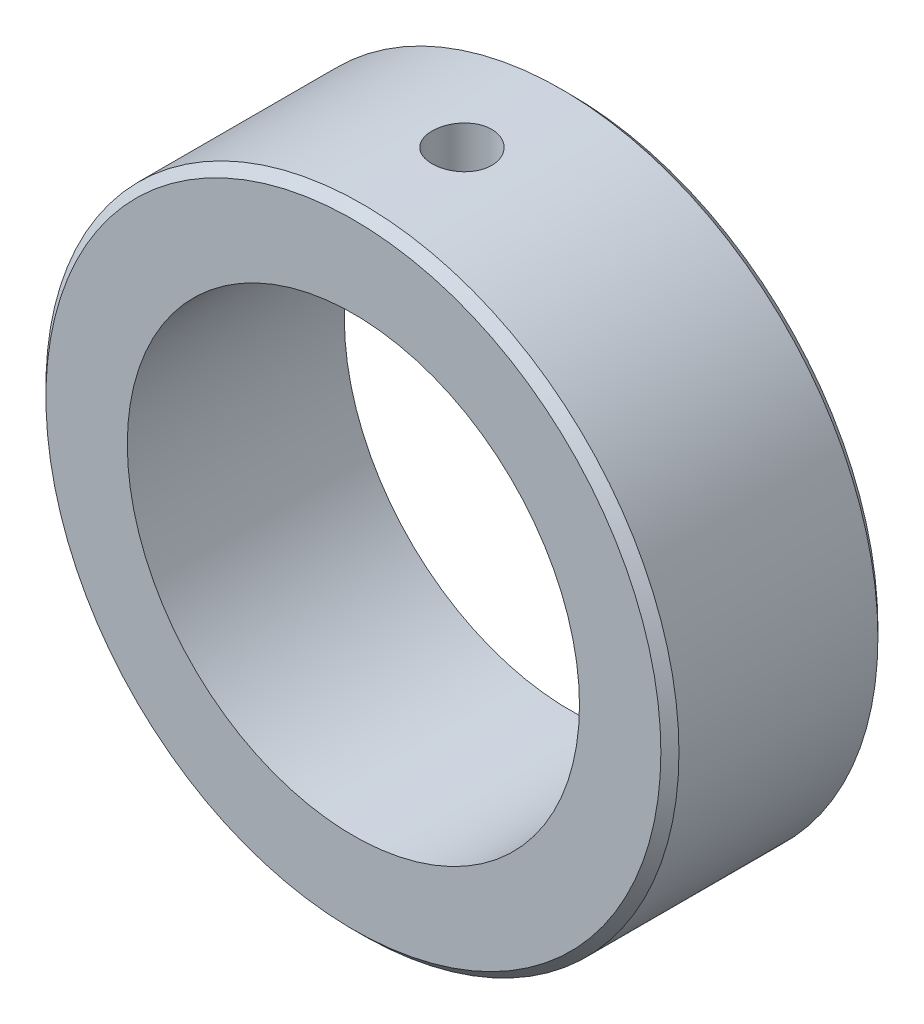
ISO-10303-21;
HEADER;
FILE_DESCRIPTION(('STEP AP214'),'2;1');
FILE_NAME('part.step','',(''),(''),'','','');
FILE_SCHEMA(('AUTOMOTIVE_DESIGN { 1 0 10303 214 1 1 1 1 }'));
ENDSEC;
DATA;
#1=APPLICATION_CONTEXT('core data for automotive mechanical design processes');
#2=APPLICATION_PROTOCOL_DEFINITION('international standard','automotive_design',2000,#1);
#3=PRODUCT_CONTEXT('',#1,'mechanical');
#4=PRODUCT('Part','Part','',(#3));
#5=PRODUCT_RELATED_PRODUCT_CATEGORY('part','',(#4));
#6=PRODUCT_DEFINITION_FORMATION('','',#4);
#7=PRODUCT_DEFINITION_CONTEXT('part definition',#1,'design');
#8=PRODUCT_DEFINITION('design','',#6,#7);
#9=PRODUCT_DEFINITION_SHAPE('','',#8);
#10=(LENGTH_UNIT() NAMED_UNIT(*) SI_UNIT(.MILLI.,.METRE.));
#11=(NAMED_UNIT(*) PLANE_ANGLE_UNIT() SI_UNIT($,.RADIAN.));
#12=(NAMED_UNIT(*) SI_UNIT($,.STERADIAN.) SOLID_ANGLE_UNIT());
#13=UNCERTAINTY_MEASURE_WITH_UNIT(LENGTH_MEASURE(1.E-05),#10,'distance_accuracy_value','');
#14=(GEOMETRIC_REPRESENTATION_CONTEXT(3) GLOBAL_UNCERTAINTY_ASSIGNED_CONTEXT((#13)) GLOBAL_UNIT_ASSIGNED_CONTEXT((#10,
#11,#12)) REPRESENTATION_CONTEXT('',''));
#15=CARTESIAN_POINT('',(0.,0.,0.));
#16=DIRECTION('',(0.,0.,1.));
#17=DIRECTION('',(1.,0.,0.));
#18=AXIS2_PLACEMENT_3D('',#15,#16,#17);
#19=CARTESIAN_POINT('',(0.,0.,6.));
#20=DIRECTION('',(0.,0.,1.));
#21=DIRECTION('',(1.,0.,0.));
#22=AXIS2_PLACEMENT_3D('',#19,#20,#21);
#23=PLANE('',#22);
#24=CARTESIAN_POINT('',(0.,0.,6.));
#25=DIRECTION('',(0.,0.,1.));
#26=DIRECTION('',(1.,0.,0.));
#27=AXIS2_PLACEMENT_3D('',#24,#25,#26);
#28=CIRCLE('',#27,17.);
#29=CARTESIAN_POINT('',(17.,0.,6.));
#30=VERTEX_POINT('',#29);
#31=EDGE_CURVE('E45',#30,#30,#28,.T.);
#32=ORIENTED_EDGE('',*,*,#31,.T.);
#33=EDGE_LOOP('',(#32));
#34=FACE_BOUND('',#33,.T.);
#35=CARTESIAN_POINT('',(0.,0.,6.));
#36=DIRECTION('',(0.,0.,1.));
#37=DIRECTION('',(1.,0.,0.));
#38=AXIS2_PLACEMENT_3D('',#35,#36,#37);
#39=CIRCLE('',#38,12.5);
#40=CARTESIAN_POINT('',(12.5,0.,6.));
#41=VERTEX_POINT('',#40);
#42=EDGE_CURVE('E56',#41,#41,#39,.T.);
#43=ORIENTED_EDGE('',*,*,#42,.F.);
#44=EDGE_LOOP('',(#43));
#45=FACE_BOUND('',#44,.T.);
#46=ADVANCED_FACE('F29',(#34,#45),#23,.T.);
#47=CARTESIAN_POINT('',(0.,0.,6.));
#48=DIRECTION('',(0.,0.,-1.));
#49=DIRECTION('',(-1.,0.,0.));
#50=AXIS2_PLACEMENT_3D('',#47,#48,#49);
#51=CYLINDRICAL_SURFACE('',#50,17.5);
#52=CARTESIAN_POINT('',(0.,0.,5.5));
#53=DIRECTION('',(0.,0.,1.));
#54=DIRECTION('',(1.,0.,0.));
#55=AXIS2_PLACEMENT_3D('',#52,#53,#54);
#56=CIRCLE('',#55,17.5);
#57=CARTESIAN_POINT('',(17.5,0.,5.5));
#58=VERTEX_POINT('',#57);
#59=EDGE_CURVE('E37',#58,#58,#56,.F.);
#60=ORIENTED_EDGE('',*,*,#59,.T.);
#61=EDGE_LOOP('',(#60));
#62=FACE_BOUND('',#61,.T.);
#63=CARTESIAN_POINT('',(0.,0.,-5.49999999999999));
#64=DIRECTION('',(0.,0.,1.));
#65=DIRECTION('',(1.,0.,0.));
#66=AXIS2_PLACEMENT_3D('',#63,#64,#65);
#67=CIRCLE('',#66,17.5);
#68=CARTESIAN_POINT('',(17.5,0.,-5.49999999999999));
#69=VERTEX_POINT('',#68);
#70=EDGE_CURVE('E41',#69,#69,#67,.T.);
#71=ORIENTED_EDGE('',*,*,#70,.T.);
#72=EDGE_LOOP('',(#71));
#73=FACE_BOUND('',#72,.T.);
#74=CARTESIAN_POINT('',(0.,17.5,-1.65));
#75=CARTESIAN_POINT('',(0.0924609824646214,17.4999989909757,-1.64999598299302));
#76=CARTESIAN_POINT('',(0.184983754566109,17.4992594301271,-1.64220199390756));
#77=CARTESIAN_POINT('',(0.3674660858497,17.496380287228,-1.61122684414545));
#78=CARTESIAN_POINT('',(0.45742267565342,17.4942391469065,-1.58802855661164));
#79=CARTESIAN_POINT('',(0.632103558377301,17.4887986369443,-1.52692450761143));
#80=CARTESIAN_POINT('',(0.716830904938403,17.4854999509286,-1.48902742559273));
#81=CARTESIAN_POINT('',(0.878702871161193,17.4781135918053,-1.39961792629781));
#82=CARTESIAN_POINT('',(0.955849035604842,17.4740260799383,-1.34810829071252));
#83=CARTESIAN_POINT('',(1.10063611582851,17.4655055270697,-1.2327576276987));
#84=CARTESIAN_POINT('',(1.16824923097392,17.4610715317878,-1.16888177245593));
#85=CARTESIAN_POINT('',(1.29181211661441,17.4523656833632,-1.03068595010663));
#86=CARTESIAN_POINT('',(1.34776135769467,17.4480938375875,-0.956365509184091));
#87=CARTESIAN_POINT('',(1.4465053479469,17.4401860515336,-0.799218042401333));
#88=CARTESIAN_POINT('',(1.48927517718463,17.4365513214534,-0.716375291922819));
#89=CARTESIAN_POINT('',(1.56028712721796,17.4303408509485,-0.544644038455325));
#90=CARTESIAN_POINT('',(1.58852956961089,17.4277650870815,-0.455755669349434));
#91=CARTESIAN_POINT('',(1.62960320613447,17.4239726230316,-0.274738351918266));
#92=CARTESIAN_POINT('',(1.64248025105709,17.4227518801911,-0.182619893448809));
#93=CARTESIAN_POINT('',(1.65259926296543,17.4217950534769,0.00247829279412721));
#94=CARTESIAN_POINT('',(1.64984159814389,17.4220589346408,0.0954580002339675));
#95=CARTESIAN_POINT('',(1.62880729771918,17.4240378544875,0.2793239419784));
#96=CARTESIAN_POINT('',(1.61058064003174,17.4257482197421,0.370215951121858));
#97=CARTESIAN_POINT('',(1.55920346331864,17.430420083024,0.547645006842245));
#98=CARTESIAN_POINT('',(1.52605276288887,17.4333815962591,0.634182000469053));
#99=CARTESIAN_POINT('',(1.4457130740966,17.4402274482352,0.800602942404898));
#100=CARTESIAN_POINT('',(1.39850182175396,17.4441132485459,0.880476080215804));
#101=CARTESIAN_POINT('',(1.29139719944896,17.4523685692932,1.03118373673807));
#102=CARTESIAN_POINT('',(1.23150349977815,17.4567381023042,1.10201802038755));
#103=CARTESIAN_POINT('',(1.10045458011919,17.4654893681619,1.23292772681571));
#104=CARTESIAN_POINT('',(1.02925618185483,17.469871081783,1.29295993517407));
#105=CARTESIAN_POINT('',(0.877769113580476,17.4781367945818,1.40022675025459));
#106=CARTESIAN_POINT('',(0.797480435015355,17.4820207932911,1.4474613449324));
#107=CARTESIAN_POINT('',(0.630062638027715,17.4888545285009,1.5277900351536));
#108=CARTESIAN_POINT('',(0.542932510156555,17.4918041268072,1.56088203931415));
#109=CARTESIAN_POINT('',(0.364318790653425,17.4964352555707,1.6119550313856));
#110=CARTESIAN_POINT('',(0.272835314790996,17.498116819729,1.62993642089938));
#111=CARTESIAN_POINT('',(0.0884861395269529,17.5000180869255,1.65022316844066));
#112=CARTESIAN_POINT('',(-0.00437294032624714,17.5002433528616,1.6525881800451));
#113=CARTESIAN_POINT('',(-0.189166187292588,17.4992215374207,1.64173156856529));
#114=CARTESIAN_POINT('',(-0.281100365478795,17.4979744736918,1.62851013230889));
#115=CARTESIAN_POINT('',(-0.461262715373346,17.4941517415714,1.58690540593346));
#116=CARTESIAN_POINT('',(-0.549497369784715,17.4915785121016,1.55854994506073));
#117=CARTESIAN_POINT('',(-0.719957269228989,17.4853922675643,1.48751061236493));
#118=CARTESIAN_POINT('',(-0.802182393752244,17.4817792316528,1.44482645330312));
#119=CARTESIAN_POINT('',(-0.958559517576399,17.4739039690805,1.34619271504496));
#120=CARTESIAN_POINT('',(-1.0326866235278,17.4696398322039,1.29020382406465));
#121=CARTESIAN_POINT('',(-1.17051178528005,17.4609472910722,1.16660645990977));
#122=CARTESIAN_POINT('',(-1.23420960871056,17.4565188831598,1.09899772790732));
#123=CARTESIAN_POINT('',(-1.34957427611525,17.4479802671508,0.953820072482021));
#124=CARTESIAN_POINT('',(-1.40120204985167,17.4438711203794,0.876220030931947));
#125=CARTESIAN_POINT('',(-1.49069276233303,17.436452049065,0.713416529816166));
#126=CARTESIAN_POINT('',(-1.5285558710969,17.4331421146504,0.62821316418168));
#127=CARTESIAN_POINT('',(-1.58937663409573,17.4277026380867,0.452757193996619));
#128=CARTESIAN_POINT('',(-1.61235777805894,17.4255712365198,0.362512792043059));
#129=CARTESIAN_POINT('',(-1.6428385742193,17.4227242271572,0.17942512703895));
#130=CARTESIAN_POINT('',(-1.65033861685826,17.4220085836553,0.086581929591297));
#131=CARTESIAN_POINT('',(-1.64963922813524,17.4220747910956,-0.0986795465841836));
#132=CARTESIAN_POINT('',(-1.64150117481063,17.422850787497,-0.191098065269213));
#133=CARTESIAN_POINT('',(-1.60988503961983,17.4258003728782,-0.373249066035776));
#134=CARTESIAN_POINT('',(-1.58640693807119,17.427973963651,-0.462981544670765));
#135=CARTESIAN_POINT('',(-1.52479361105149,17.4334722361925,-0.637214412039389));
#136=CARTESIAN_POINT('',(-1.48665994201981,17.436796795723,-0.721715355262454));
#137=CARTESIAN_POINT('',(-1.39682444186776,17.4442226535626,-0.883126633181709));
#138=CARTESIAN_POINT('',(-1.34512273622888,17.4483239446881,-0.960037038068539));
#139=CARTESIAN_POINT('',(-1.22938806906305,17.4568603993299,-1.10439853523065));
#140=CARTESIAN_POINT('',(-1.16530944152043,17.4612967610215,-1.17181294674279));
#141=CARTESIAN_POINT('',(-1.0267281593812,17.4699925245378,-1.29496048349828));
#142=CARTESIAN_POINT('',(-0.952223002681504,17.4742518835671,-1.35069079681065));
#143=CARTESIAN_POINT('',(-0.794721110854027,17.4821235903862,-1.4489853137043));
#144=CARTESIAN_POINT('',(-0.711705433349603,17.4857344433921,-1.49151926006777));
#145=CARTESIAN_POINT('',(-0.539730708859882,17.4918856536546,-1.56198816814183));
#146=CARTESIAN_POINT('',(-0.450778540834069,17.494427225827,-1.58993970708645));
#147=CARTESIAN_POINT('',(-0.301095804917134,17.4975098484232,-1.62342633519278));
#148=CARTESIAN_POINT('',(-0.241324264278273,17.4984393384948,-1.63337797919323));
#149=CARTESIAN_POINT('',(-0.12104397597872,17.4996847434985,-1.64666611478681));
#150=CARTESIAN_POINT('',(-0.0605352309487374,17.5000006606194,-1.65000262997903));
#151=CARTESIAN_POINT('',(0.,17.5,-1.65));
#152=B_SPLINE_CURVE_WITH_KNOTS('',3,(#74,#75,#76,#77,#78,#79,#80,#81,#82,#83,#84,#85,#86,#87,
#88,#89,#90,#91,#92,#93,#94,#95,#96,#97,#98,#99,#100,#101,#102,#103,#104,#105,#106,#107,#108,
#109,#110,#111,#112,#113,#114,#115,#116,#117,#118,#119,#120,#121,#122,#123,#124,#125,#126,#127,
#128,#129,#130,#131,#132,#133,#134,#135,#136,#137,#138,#139,#140,#141,#142,#143,#144,#145,#146,
#147,#148,#149,#150,#151),.UNSPECIFIED.,.T.,.F.,(4,2,2,2,2,2,2,2,2,2,2,2,2,2,2,2,2,2,2,2,2,2,2,
2,2,2,2,2,2,2,2,2,2,2,2,2,2,2,4),(0.,0.277161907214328,0.554632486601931,0.831939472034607,
1.10918983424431,1.38723270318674,1.6652881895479,1.94386624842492,2.22243814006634,
2.50017666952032,2.77790865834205,3.05474673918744,3.33158818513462,3.60887034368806,
3.88615971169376,4.16453485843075,4.44291026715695,4.72132682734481,4.99973598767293,
5.27708102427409,5.55442273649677,5.83125620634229,6.10809522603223,6.3857626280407,
6.66343621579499,6.94199654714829,7.2205534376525,7.49866957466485,7.77677869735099,
8.05379849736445,8.33081865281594,8.60780939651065,8.88479757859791,9.16282796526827,
9.4409251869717,9.71965540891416,9.99806807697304,10.1795296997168,10.3609906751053),.UNSPECIFIED.);
#153=CARTESIAN_POINT('',(0.,17.5,-1.65));
#154=VERTEX_POINT('',#153);
#155=EDGE_CURVE('E50',#154,#154,#152,.T.);
#156=ORIENTED_EDGE('',*,*,#155,.T.);
#157=EDGE_LOOP('',(#156));
#158=FACE_BOUND('',#157,.T.);
#159=ADVANCED_FACE('F31',(#62,#73,#158),#51,.T.);
#160=CARTESIAN_POINT('',(0.,0.,6.));
#161=DIRECTION('',(0.,0.,-1.));
#162=DIRECTION('',(-1.,0.,0.));
#163=AXIS2_PLACEMENT_3D('',#160,#161,#162);
#164=CYLINDRICAL_SURFACE('',#163,12.5);
#165=CARTESIAN_POINT('',(0.,12.5,-1.65));
#166=CARTESIAN_POINT('',(0.0922509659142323,12.4999986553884,-1.64999610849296));
#167=CARTESIAN_POINT('',(0.184558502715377,12.498968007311,-1.64223732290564));
#168=CARTESIAN_POINT('',(0.366601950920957,12.4949556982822,-1.61141019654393));
#169=CARTESIAN_POINT('',(0.456335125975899,12.4919720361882,-1.58832615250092));
#170=CARTESIAN_POINT('',(0.630568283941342,12.4843896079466,-1.52754306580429));
#171=CARTESIAN_POINT('',(0.715071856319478,12.4797919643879,-1.48985417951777));
#172=CARTESIAN_POINT('',(0.876539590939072,12.4694920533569,-1.40095418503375));
#173=CARTESIAN_POINT('',(0.953504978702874,12.4637899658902,-1.34974527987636));
#174=CARTESIAN_POINT('',(1.09819718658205,12.4518781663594,-1.2349246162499));
#175=CARTESIAN_POINT('',(1.16587128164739,12.4456658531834,-1.17124667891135));
#176=CARTESIAN_POINT('',(1.28960557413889,12.4334545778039,-1.0334377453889));
#177=CARTESIAN_POINT('',(1.34566516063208,12.4274556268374,-0.959306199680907));
#178=CARTESIAN_POINT('',(1.44477796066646,12.4163248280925,-0.802348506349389));
#179=CARTESIAN_POINT('',(1.48778133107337,12.4111963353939,-0.719490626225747));
#180=CARTESIAN_POINT('',(1.55924262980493,12.4024218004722,-0.54764984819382));
#181=CARTESIAN_POINT('',(1.58770117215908,12.3987756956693,-0.458667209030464));
#182=CARTESIAN_POINT('',(1.62910377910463,12.3934038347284,-0.277652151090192));
#183=CARTESIAN_POINT('',(1.64213723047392,12.3916670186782,-0.185640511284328));
#184=CARTESIAN_POINT('',(1.6525963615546,12.3902766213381,-0.000720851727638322));
#185=CARTESIAN_POINT('',(1.65002273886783,12.3906229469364,0.0921871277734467));
#186=CARTESIAN_POINT('',(1.62941406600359,12.3933495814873,0.275636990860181));
#187=CARTESIAN_POINT('',(1.61147776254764,12.395716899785,0.366190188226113));
#188=CARTESIAN_POINT('',(1.56080707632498,12.4021985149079,0.542990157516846));
#189=CARTESIAN_POINT('',(1.52807236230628,12.4063128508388,0.6292368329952));
#190=CARTESIAN_POINT('',(1.44862884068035,12.4158395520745,0.795280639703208));
#191=CARTESIAN_POINT('',(1.40187740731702,12.4212558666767,0.875057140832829));
#192=CARTESIAN_POINT('',(1.29575800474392,12.4327732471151,1.02566987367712));
#193=CARTESIAN_POINT('',(1.23638939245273,12.4388743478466,1.09650564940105));
#194=CARTESIAN_POINT('',(1.10617499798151,12.4511315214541,1.22779910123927));
#195=CARTESIAN_POINT('',(1.03524415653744,12.4572876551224,1.288172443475));
#196=CARTESIAN_POINT('',(0.884210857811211,12.4689172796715,1.3961696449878));
#197=CARTESIAN_POINT('',(0.804108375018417,12.4743907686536,1.44379346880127));
#198=CARTESIAN_POINT('',(0.636938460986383,12.484042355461,1.5249409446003));
#199=CARTESIAN_POINT('',(0.549868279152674,12.4882199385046,1.55845899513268));
#200=CARTESIAN_POINT('',(0.371267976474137,12.4948044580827,1.61037485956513));
#201=CARTESIAN_POINT('',(0.279738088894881,12.4972114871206,1.62877346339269));
#202=CARTESIAN_POINT('',(0.095545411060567,12.4999716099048,1.64981811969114));
#203=CARTESIAN_POINT('',(0.00289610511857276,12.5003398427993,1.65258028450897));
#204=CARTESIAN_POINT('',(-0.181544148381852,12.4990218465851,1.64258054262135));
#205=CARTESIAN_POINT('',(-0.273335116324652,12.4973356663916,1.62981900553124));
#206=CARTESIAN_POINT('',(-0.453108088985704,12.4921077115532,1.5892306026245));
#207=CARTESIAN_POINT('',(-0.541102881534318,12.4885727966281,1.56145941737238));
#208=CARTESIAN_POINT('',(-0.711186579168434,12.4800429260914,1.49169814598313));
#209=CARTESIAN_POINT('',(-0.793275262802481,12.4750479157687,1.44970752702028));
#210=CARTESIAN_POINT('',(-0.949733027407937,12.4641165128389,1.35242066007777));
#211=CARTESIAN_POINT('',(-1.02405527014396,12.4581748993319,1.29704968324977));
#212=CARTESIAN_POINT('',(-1.16239311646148,12.4460304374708,1.17467915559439));
#213=CARTESIAN_POINT('',(-1.22640826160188,12.4398275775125,1.10767908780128));
#214=CARTESIAN_POINT('',(-1.34272949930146,12.427812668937,0.963439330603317));
#215=CARTESIAN_POINT('',(-1.39495839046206,12.422003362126,0.886137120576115));
#216=CARTESIAN_POINT('',(-1.48569034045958,12.4114793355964,0.723789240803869));
#217=CARTESIAN_POINT('',(-1.52419370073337,12.40676459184,0.638743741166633));
#218=CARTESIAN_POINT('',(-1.5862580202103,12.3989825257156,0.46356754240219));
#219=CARTESIAN_POINT('',(-1.60986174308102,12.395910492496,0.373452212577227));
#220=CARTESIAN_POINT('',(-1.64159408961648,12.3917484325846,0.190493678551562));
#221=CARTESIAN_POINT('',(-1.64972352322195,12.390658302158,0.0976506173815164));
#222=CARTESIAN_POINT('',(-1.65026050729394,12.3905867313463,-0.0873595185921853));
#223=CARTESIAN_POINT('',(-1.64278936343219,12.3915890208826,-0.179526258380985));
#224=CARTESIAN_POINT('',(-1.61259495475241,12.3955542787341,-0.361281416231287));
#225=CARTESIAN_POINT('',(-1.58987169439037,12.3985172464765,-0.450869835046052));
#226=CARTESIAN_POINT('',(-1.52985734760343,12.4060648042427,-0.624904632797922));
#227=CARTESIAN_POINT('',(-1.49257280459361,12.4106486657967,-0.709353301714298));
#228=CARTESIAN_POINT('',(-1.40450618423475,12.4209226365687,-0.870815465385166));
#229=CARTESIAN_POINT('',(-1.35372386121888,12.4266127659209,-0.947828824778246));
#230=CARTESIAN_POINT('',(-1.23965546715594,12.4385110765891,-1.09285344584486));
#231=CARTESIAN_POINT('',(-1.17627910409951,12.4447228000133,-1.1607934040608));
#232=CARTESIAN_POINT('',(-1.03901112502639,12.4569335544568,-1.28511935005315));
#233=CARTESIAN_POINT('',(-0.965117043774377,12.4629325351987,-1.3415026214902));
#234=CARTESIAN_POINT('',(-0.808549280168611,12.4740702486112,-1.44132111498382));
#235=CARTESIAN_POINT('',(-0.725839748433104,12.4792052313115,-1.48470050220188));
#236=CARTESIAN_POINT('',(-0.554286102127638,12.4879988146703,-1.55689083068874));
#237=CARTESIAN_POINT('',(-0.465448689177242,12.4916589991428,-1.58571740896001));
#238=CARTESIAN_POINT('',(-0.313472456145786,12.4962204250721,-1.62117734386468));
#239=CARTESIAN_POINT('',(-0.251287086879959,12.4976307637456,-1.63197005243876));
#240=CARTESIAN_POINT('',(-0.126076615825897,12.4995210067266,-1.6463826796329));
#241=CARTESIAN_POINT('',(-0.06305152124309,12.5000009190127,-1.6500026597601));
#242=CARTESIAN_POINT('',(0.,12.5,-1.65));
#243=B_SPLINE_CURVE_WITH_KNOTS('',3,(#165,#166,#167,#168,#169,#170,#171,#172,#173,#174,#175,
#176,#177,#178,#179,#180,#181,#182,#183,#184,#185,#186,#187,#188,#189,#190,#191,#192,#193,#194,
#195,#196,#197,#198,#199,#200,#201,#202,#203,#204,#205,#206,#207,#208,#209,#210,#211,#212,#213,
#214,#215,#216,#217,#218,#219,#220,#221,#222,#223,#224,#225,#226,#227,#228,#229,#230,#231,#232,
#233,#234,#235,#236,#237,#238,#239,#240,#241,#242),.UNSPECIFIED.,.T.,.F.,(4,2,2,2,2,2,2,2,2,2,2,
2,2,2,2,2,2,2,2,2,2,2,2,2,2,2,2,2,2,2,2,2,2,2,2,2,2,2,4),(0.,0.27652256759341,0.553328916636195,
0.829943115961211,1.106512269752,1.38459116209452,1.66268467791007,1.94182686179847,
2.22095726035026,2.49846208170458,2.77595449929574,3.05167655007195,3.32740477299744,
3.60398015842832,3.88056964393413,4.15929423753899,4.43801960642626,4.71685555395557,
4.99567693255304,5.27242510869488,5.54916669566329,5.82488864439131,6.10062092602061,
6.37793027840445,6.65525196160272,6.93434056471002,7.21342303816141,7.49170082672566,
7.76996404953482,8.04607163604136,8.32217914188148,8.59816271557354,8.87415131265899,
9.15219502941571,9.43030402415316,9.70959057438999,9.9885763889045,10.1775751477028,
10.3665722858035),.UNSPECIFIED.);
#244=CARTESIAN_POINT('',(0.,12.5,-1.65));
#245=VERTEX_POINT('',#244);
#246=EDGE_CURVE('E70',#245,#245,#243,.T.);
#247=ORIENTED_EDGE('',*,*,#246,.F.);
#248=EDGE_LOOP('',(#247));
#249=FACE_BOUND('',#248,.T.);
#250=ORIENTED_EDGE('',*,*,#42,.T.);
#251=EDGE_LOOP('',(#250));
#252=FACE_BOUND('',#251,.T.);
#253=CARTESIAN_POINT('',(0.,0.,-6.));
#254=DIRECTION('',(0.,0.,1.));
#255=DIRECTION('',(1.,0.,0.));
#256=AXIS2_PLACEMENT_3D('',#253,#254,#255);
#257=CIRCLE('',#256,12.5);
#258=CARTESIAN_POINT('',(12.5,0.,-6.));
#259=VERTEX_POINT('',#258);
#260=EDGE_CURVE('E74',#259,#259,#257,.T.);
#261=ORIENTED_EDGE('',*,*,#260,.F.);
#262=EDGE_LOOP('',(#261));
#263=FACE_BOUND('',#262,.T.);
#264=ADVANCED_FACE('F75',(#249,#252,#263),#164,.F.);
#265=CARTESIAN_POINT('',(0.,0.,-6.));
#266=DIRECTION('',(0.,0.,1.));
#267=DIRECTION('',(1.,0.,0.));
#268=AXIS2_PLACEMENT_3D('',#265,#266,#267);
#269=PLANE('',#268);
#270=CARTESIAN_POINT('',(0.,0.,-6.));
#271=DIRECTION('',(0.,0.,1.));
#272=DIRECTION('',(1.,0.,0.));
#273=AXIS2_PLACEMENT_3D('',#270,#271,#272);
#274=CIRCLE('',#273,17.);
#275=CARTESIAN_POINT('',(17.,0.,-6.));
#276=VERTEX_POINT('',#275);
#277=EDGE_CURVE('E10',#276,#276,#274,.F.);
#278=ORIENTED_EDGE('',*,*,#277,.T.);
#279=EDGE_LOOP('',(#278));
#280=FACE_BOUND('',#279,.T.);
#281=ORIENTED_EDGE('',*,*,#260,.T.);
#282=EDGE_LOOP('',(#281));
#283=FACE_BOUND('',#282,.T.);
#284=ADVANCED_FACE('F64',(#280,#283),#269,.F.);
#285=CARTESIAN_POINT('',(0.,0.,0.));
#286=DIRECTION('',(0.,-1.,0.));
#287=DIRECTION('',(0.,0.,-1.));
#288=AXIS2_PLACEMENT_3D('',#285,#286,#287);
#289=CYLINDRICAL_SURFACE('',#288,1.65);
#290=ORIENTED_EDGE('',*,*,#246,.T.);
#291=EDGE_LOOP('',(#290));
#292=FACE_BOUND('',#291,.T.);
#293=ORIENTED_EDGE('',*,*,#155,.F.);
#294=EDGE_LOOP('',(#293));
#295=FACE_BOUND('',#294,.T.);
#296=ADVANCED_FACE('F58',(#292,#295),#289,.F.);
#297=CARTESIAN_POINT('',(0.,0.,6.));
#298=DIRECTION('',(0.,0.,-1.));
#299=DIRECTION('',(-1.,0.,0.));
#300=AXIS2_PLACEMENT_3D('',#297,#298,#299);
#301=CONICAL_SURFACE('',#300,17.,0.785398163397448);
#302=ORIENTED_EDGE('',*,*,#59,.F.);
#303=EDGE_LOOP('',(#302));
#304=FACE_BOUND('',#303,.T.);
#305=ORIENTED_EDGE('',*,*,#31,.F.);
#306=EDGE_LOOP('',(#305));
#307=FACE_BOUND('',#306,.T.);
#308=ADVANCED_FACE('F63',(#304,#307),#301,.T.);
#309=CARTESIAN_POINT('',(0.,0.,-5.49999999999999));
#310=DIRECTION('',(0.,0.,1.));
#311=DIRECTION('',(1.,0.,0.));
#312=AXIS2_PLACEMENT_3D('',#309,#310,#311);
#313=CONICAL_SURFACE('',#312,17.5,0.785398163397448);
#314=ORIENTED_EDGE('',*,*,#277,.F.);
#315=EDGE_LOOP('',(#314));
#316=FACE_BOUND('',#315,.T.);
#317=ORIENTED_EDGE('',*,*,#70,.F.);
#318=EDGE_LOOP('',(#317));
#319=FACE_BOUND('',#318,.T.);
#320=ADVANCED_FACE('F109',(#316,#319),#313,.T.);
#321=CLOSED_SHELL('',(#46,#159,#264,#284,#296,#308,#320));
#322=MANIFOLD_SOLID_BREP('B2',#321);
#323=ADVANCED_BREP_SHAPE_REPRESENTATION('',(#18,#322),#14);
#324=SHAPE_DEFINITION_REPRESENTATION(#9,#323);
ENDSEC;
END-ISO-10303-21;
